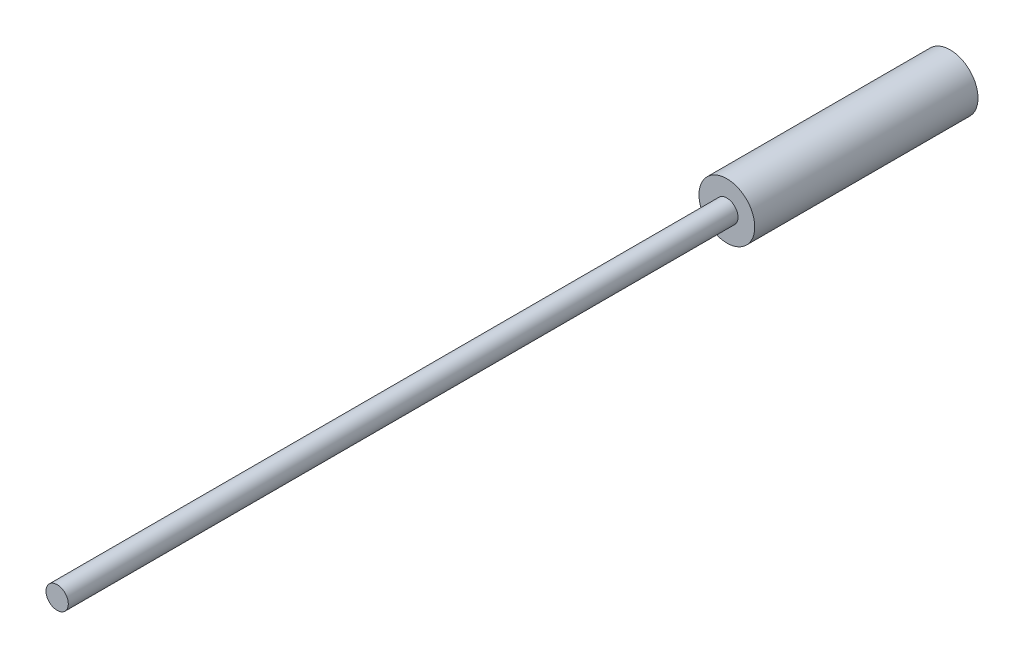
from build123d import *

# Parameters (mm, degrees)
SKETCH_1_R          = 1.25
EXTRUDE_1_DEPTH     = 10
SKETCH_2_R          = 0.5
EXTRUDE_2_DEPTH     = 30
SKETCH_3_R          = 0.0675
SKETCH_3_R_2        = 0.0625
CUT_EXTRUDE_1_DEPTH = 0.1


with BuildPart() as part:
    # Sketch 1 → Extrude 1 (new body)
    with BuildSketch(Plane.XY):
        Circle(SKETCH_1_R)
    extrude(amount=EXTRUDE_1_DEPTH)

    # Sketch 2 → Extrude 2 (add)
    with BuildSketch(Plane.XY.offset(10)):
        Circle(SKETCH_2_R)
    extrude(amount=EXTRUDE_2_DEPTH)

    # Sketch 3 → Cut-Extrude 1 (cut)
    with BuildSketch(Plane(origin=(0, 0, 0), x_dir=(-1, 0, 0), z_dir=(0, 0, -1))):
        Circle(SKETCH_3_R)
        Circle(SKETCH_3_R_2, mode=Mode.SUBTRACT)
    extrude(amount=-CUT_EXTRUDE_1_DEPTH, mode=Mode.SUBTRACT)


solid = part.part
